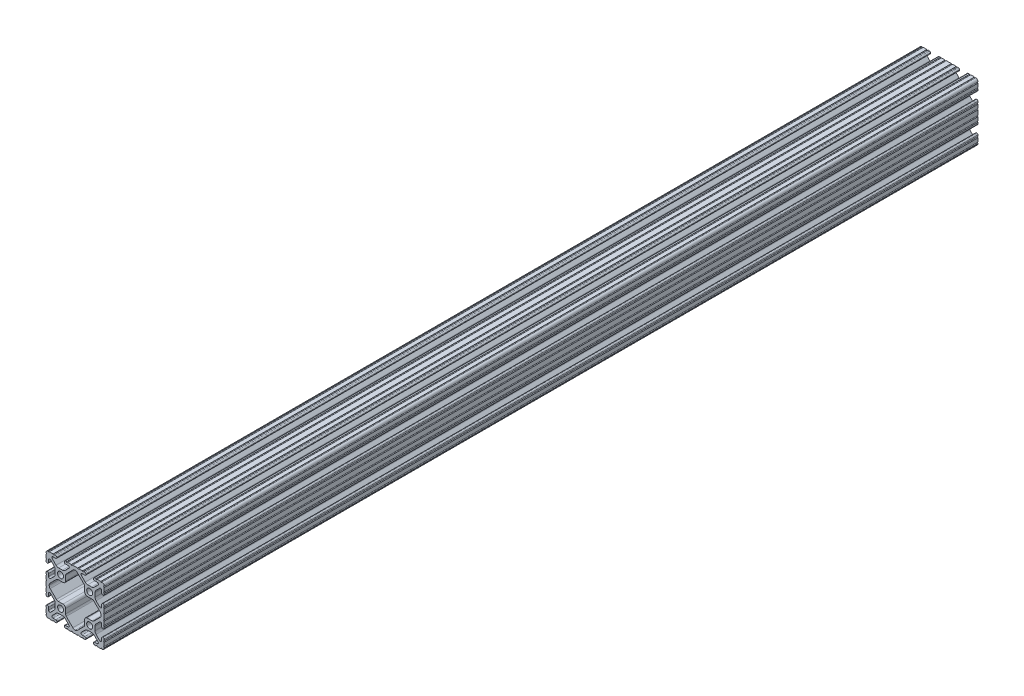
from build123d import *

# Parameters (mm, degrees)
SKETCH1_R      = 2.6035
EXTRUDE1_DEPTH = 381


with BuildPart() as part:
    # Sketch1 → Extrude1 (new, symmetric)
    with BuildSketch(Plane.XY):
        with BuildLine():
            Line((7.457926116, -25.399784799), (8.405129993, -25.399784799))
            ThreePointArc((8.405129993, -25.399784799), (9.151169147, -25.100147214), (9.461499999, -24.358492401))
            Line((9.461499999, -24.358492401), (9.461499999, -24.231492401))
            ThreePointArc((9.461499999, -24.231492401), (9.151169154, -23.489837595), (8.405130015, -23.190200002))
            Line((8.405130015, -23.190200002), (6.087754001, -23.190200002))
            ThreePointArc((6.087754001, -23.190200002), (5.173448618, -22.579280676), (5.387974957, -21.500783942))
            Line((5.387974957, -21.500783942), (8.763022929, -18.12573597))
            ThreePointArc((8.763022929, -18.12573597), (9.793067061, -17.437482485), (11.008086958, -17.195800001))
            Line((11.008086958, -17.195800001), (14.391913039, -17.195800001))
            ThreePointArc((14.391913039, -17.195800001), (15.606932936, -17.437482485), (16.636977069, -18.12573597))
            Line((16.636977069, -18.12573597), (20.01202504, -21.500783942))
            ThreePointArc((20.01202504, -21.500783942), (20.223734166, -22.586011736), (19.297652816, -23.190092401))
            Line((19.297652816, -23.190092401), (16.979899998, -23.190092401))
            ThreePointArc((16.979899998, -23.190092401), (16.243518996, -23.495111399), (15.938499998, -24.231492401))
            Line((15.938499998, -24.231492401), (15.938499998, -24.358492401))
            ThreePointArc((15.938499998, -24.358492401), (16.248830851, -25.100147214), (16.994870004, -25.399784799))
            Line((16.994870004, -25.399784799), (18.13401566, -25.399784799))
            ThreePointArc((18.13401566, -25.399784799), (18.636212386, -24.81521817), (19.138409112, -25.399784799))
            Line((19.138409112, -25.399784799), (22.413213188, -25.399784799))
            ThreePointArc((22.413213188, -25.399784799), (22.915409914, -24.815218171), (23.41760664, -25.399784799))
            Line((23.41760664, -25.399784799), (23.450078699, -25.399784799))
            ThreePointArc((23.450078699, -25.399784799), (24.83746982, -24.731205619), (25.399999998, -23.297534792))
            Line((25.399999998, -23.297534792), (25.399999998, -23.268649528))
            ThreePointArc((25.399999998, -23.268649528), (24.891999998, -22.760649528), (25.399999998, -22.252649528))
            Line((25.399999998, -22.252649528), (25.399999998, -19.025239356))
            ThreePointArc((25.399999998, -19.025239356), (24.891999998, -18.517239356), (25.399999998, -18.009239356))
            Line((25.399999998, -18.009239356), (25.399999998, -16.916041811))
            ThreePointArc((25.399999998, -16.916041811), (25.094981, -16.179660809), (24.358599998, -15.874641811))
            Line((24.358599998, -15.874641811), (24.231599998, -15.874641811))
            ThreePointArc((24.231599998, -15.874641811), (23.495218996, -16.179660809), (23.190199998, -16.916041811))
            Line((23.190199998, -16.916041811), (23.190199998, -19.10098879))
            ThreePointArc((23.190199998, -19.10098879), (22.563006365, -20.039650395), (21.455779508, -19.81940928))
            Line((21.455779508, -19.81940928), (18.278135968, -16.641765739))
            ThreePointArc((18.278135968, -16.641765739), (17.589882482, -15.611721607), (17.348199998, -14.396701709))
            Line((17.348199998, -14.396701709), (17.348199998, -11.003495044))
            ThreePointArc((17.348199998, -11.003495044), (17.59061076, -9.786718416), (18.280826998, -8.755743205))
            Line((18.280826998, -8.755743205), (21.456640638, -5.587529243))
            ThreePointArc((21.456640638, -5.587529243), (22.563568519, -5.368381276), (23.190199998, -6.306809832))
            Line((23.190199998, -6.306809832), (23.190199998, -8.483958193))
            ThreePointArc((23.190199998, -8.483958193), (23.495218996, -9.220339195), (24.231599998, -9.525358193))
            Line((24.231599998, -9.525358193), (24.358599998, -9.525358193))
            ThreePointArc((24.358599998, -9.525358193), (25.094981, -9.220339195), (25.399999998, -8.483958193))
            Line((25.399999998, -8.483958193), (25.399999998, -7.327686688))
            ThreePointArc((25.399999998, -7.327686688), (24.891999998, -6.819686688), (25.399999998, -6.311686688))
            Line((25.399999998, -6.311686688), (25.399999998, -3.084276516))
            ThreePointArc((25.399999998, -3.084276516), (24.891999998, -2.576276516), (25.399999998, -2.068276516))
            Line((25.399999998, -2.068276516), (25.399999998, 2.068276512))
            ThreePointArc((25.399999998, 2.068276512), (24.891999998, 2.576276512), (25.399999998, 3.084276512))
            Line((25.399999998, 3.084276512), (25.399999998, 6.311686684))
            ThreePointArc((25.399999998, 6.311686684), (24.891999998, 6.819686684), (25.399999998, 7.327686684))
            Line((25.399999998, 7.327686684), (25.399999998, 8.483958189))
            ThreePointArc((25.399999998, 8.483958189), (25.094981, 9.220339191), (24.358599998, 9.525358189))
            Line((24.358599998, 9.525358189), (24.231599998, 9.525358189))
            ThreePointArc((24.231599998, 9.525358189), (23.495218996, 9.220339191), (23.190199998, 8.483958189))
            Line((23.190199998, 8.483958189), (23.190199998, 6.306809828))
            ThreePointArc((23.190199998, 6.306809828), (22.563568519, 5.368381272), (21.456640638, 5.58752924))
            Line((21.456640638, 5.58752924), (18.280826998, 8.755743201))
            ThreePointArc((18.280826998, 8.755743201), (17.59061076, 9.786718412), (17.348199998, 11.00349504))
            Line((17.348199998, 11.00349504), (17.348199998, 14.396701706))
            ThreePointArc((17.348199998, 14.396701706), (17.589882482, 15.611721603), (18.278135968, 16.641765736))
            Line((18.278135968, 16.641765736), (21.455779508, 19.819409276))
            ThreePointArc((21.455779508, 19.819409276), (22.563006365, 20.039650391), (23.190199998, 19.100988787))
            Line((23.190199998, 19.100988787), (23.190199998, 16.916041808))
            ThreePointArc((23.190199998, 16.916041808), (23.495218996, 16.179660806), (24.231599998, 15.874641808))
            Line((24.231599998, 15.874641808), (24.358599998, 15.874641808))
            ThreePointArc((24.358599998, 15.874641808), (25.094981, 16.179660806), (25.399999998, 16.916041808))
            Line((25.399999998, 16.916041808), (25.399999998, 18.009239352))
            ThreePointArc((25.399999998, 18.009239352), (24.891999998, 18.517239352), (25.399999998, 19.025239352))
            Line((25.399999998, 19.025239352), (25.399999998, 22.252649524))
            ThreePointArc((25.399999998, 22.252649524), (24.891999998, 22.760649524), (25.399999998, 23.268649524))
            Line((25.399999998, 23.268649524), (25.399999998, 23.297534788))
            ThreePointArc((25.399999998, 23.297534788), (24.837469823, 24.731205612), (23.450078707, 25.399784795))
            Line((23.450078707, 25.399784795), (23.417606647, 25.399784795))
            ThreePointArc((23.417606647, 25.399784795), (22.915409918, 24.81521819), (22.413213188, 25.399784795))
            Line((22.413213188, 25.399784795), (19.138409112, 25.399784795))
            ThreePointArc((19.138409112, 25.399784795), (18.636212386, 24.815218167), (18.13401566, 25.399784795))
            Line((18.13401566, 25.399784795), (16.994870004, 25.399784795))
            ThreePointArc((16.994870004, 25.399784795), (16.248830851, 25.100147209), (15.938499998, 24.358492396))
            Line((15.938499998, 24.358492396), (15.938499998, 24.231492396))
            ThreePointArc((15.938499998, 24.231492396), (16.243518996, 23.495111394), (16.979899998, 23.190092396))
            Line((16.979899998, 23.190092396), (19.297652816, 23.190092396))
            ThreePointArc((19.297652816, 23.190092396), (20.223734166, 22.586011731), (20.01202504, 21.500783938))
            Line((20.01202504, 21.500783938), (16.636977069, 18.125735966))
            ThreePointArc((16.636977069, 18.125735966), (15.606932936, 17.437482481), (14.391913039, 17.195799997))
            Line((14.391913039, 17.195799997), (11.008086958, 17.195799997))
            ThreePointArc((11.008086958, 17.195799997), (9.793067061, 17.437482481), (8.763022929, 18.125735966))
            Line((8.763022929, 18.125735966), (5.387974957, 21.500783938))
            ThreePointArc((5.387974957, 21.500783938), (5.173448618, 22.579280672), (6.087754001, 23.190199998))
            Line((6.087754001, 23.190199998), (8.405130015, 23.190199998))
            ThreePointArc((8.405130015, 23.190199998), (9.151169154, 23.48983759), (9.461499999, 24.231492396))
            Line((9.461499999, 24.231492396), (9.461499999, 24.358492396))
            ThreePointArc((9.461499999, 24.358492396), (9.151169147, 25.10014721), (8.405129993, 25.399784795))
            Line((8.405129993, 25.399784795), (7.457926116, 25.399784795))
            ThreePointArc((7.457926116, 25.399784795), (6.95572939, 24.815218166), (6.453532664, 25.399784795))
            Line((6.453532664, 25.399784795), (3.214515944, 25.399784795))
            ThreePointArc((3.214515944, 25.399784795), (2.712319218, 24.815218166), (2.210122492, 25.399784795))
            Line((2.210122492, 25.399784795), (-2.210122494, 25.399784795))
            ThreePointArc((-2.210122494, 25.399784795), (-2.71231922, 24.815218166), (-3.214515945, 25.399784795))
            Line((-3.214515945, 25.399784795), (-6.453532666, 25.399784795))
            ThreePointArc((-6.453532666, 25.399784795), (-6.955729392, 24.815218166), (-7.457926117, 25.399784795))
            Line((-7.457926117, 25.399784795), (-8.405129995, 25.399784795))
            ThreePointArc((-8.405129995, 25.399784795), (-9.151169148, 25.10014721), (-9.461500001, 24.358492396))
            Line((-9.461500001, 24.358492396), (-9.461500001, 24.231492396))
            ThreePointArc((-9.461500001, 24.231492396), (-9.151169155, 23.48983759), (-8.405130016, 23.190199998))
            Line((-8.405130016, 23.190199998), (-6.087754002, 23.190199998))
            ThreePointArc((-6.087754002, 23.190199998), (-5.173448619, 22.579280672), (-5.387974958, 21.500783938))
            Line((-5.387974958, 21.500783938), (-8.76302293, 18.125735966))
            ThreePointArc((-8.76302293, 18.125735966), (-9.793067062, 17.437482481), (-11.00808696, 17.195799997))
            Line((-11.00808696, 17.195799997), (-14.39191304, 17.195799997))
            ThreePointArc((-14.39191304, 17.195799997), (-15.606932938, 17.437482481), (-16.63697707, 18.125735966))
            Line((-16.63697707, 18.125735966), (-20.012025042, 21.500783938))
            ThreePointArc((-20.012025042, 21.500783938), (-20.223734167, 22.586011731), (-19.297652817, 23.190092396))
            Line((-19.297652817, 23.190092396), (-16.979899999, 23.190092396))
            ThreePointArc((-16.979899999, 23.190092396), (-16.243518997, 23.495111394), (-15.938499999, 24.231492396))
            Line((-15.938499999, 24.231492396), (-15.938499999, 24.358492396))
            ThreePointArc((-15.938499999, 24.358492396), (-16.248830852, 25.100147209), (-16.994870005, 25.399784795))
            Line((-16.994870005, 25.399784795), (-18.134015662, 25.399784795))
            ThreePointArc((-18.134015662, 25.399784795), (-18.636212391, 24.815218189), (-19.13840912, 25.399784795))
            Line((-19.13840912, 25.399784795), (-22.413213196, 25.399784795))
            ThreePointArc((-22.413213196, 25.399784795), (-22.915409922, 24.815218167), (-23.417606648, 25.399784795))
            Line((-23.417606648, 25.399784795), (-23.450078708, 25.399784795))
            ThreePointArc((-23.450078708, 25.399784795), (-24.837469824, 24.731205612), (-25.399999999, 23.297534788))
            Line((-25.399999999, 23.297534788), (-25.399999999, 23.268649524))
            ThreePointArc((-25.399999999, 23.268649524), (-24.891999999, 22.760649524), (-25.399999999, 22.252649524))
            Line((-25.399999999, 22.252649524), (-25.399999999, 19.025239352))
            ThreePointArc((-25.399999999, 19.025239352), (-24.891999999, 18.517239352), (-25.399999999, 18.009239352))
            Line((-25.399999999, 18.009239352), (-25.399999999, 16.916041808))
            ThreePointArc((-25.399999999, 16.916041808), (-25.094981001, 16.179660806), (-24.358599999, 15.874641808))
            Line((-24.358599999, 15.874641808), (-24.231599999, 15.874641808))
            ThreePointArc((-24.231599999, 15.874641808), (-23.495218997, 16.179660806), (-23.190199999, 16.916041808))
            Line((-23.190199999, 16.916041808), (-23.190199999, 19.100988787))
            ThreePointArc((-23.190199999, 19.100988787), (-22.563006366, 20.039650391), (-21.45577951, 19.819409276))
            Line((-21.45577951, 19.819409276), (-18.278135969, 16.641765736))
            ThreePointArc((-18.278135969, 16.641765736), (-17.589882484, 15.611721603), (-17.348199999, 14.396701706))
            Line((-17.348199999, 14.396701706), (-17.348199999, 11.00349504))
            ThreePointArc((-17.348199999, 11.00349504), (-17.590610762, 9.786718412), (-18.280826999, 8.755743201))
            Line((-18.280826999, 8.755743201), (-21.456640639, 5.58752924))
            ThreePointArc((-21.456640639, 5.58752924), (-22.56356852, 5.368381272), (-23.190199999, 6.306809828))
            Line((-23.190199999, 6.306809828), (-23.190199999, 8.483958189))
            ThreePointArc((-23.190199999, 8.483958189), (-23.495218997, 9.220339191), (-24.231599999, 9.525358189))
            Line((-24.231599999, 9.525358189), (-24.358599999, 9.525358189))
            ThreePointArc((-24.358599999, 9.525358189), (-25.094981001, 9.220339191), (-25.399999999, 8.483958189))
            Line((-25.399999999, 8.483958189), (-25.399999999, 7.327686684))
            ThreePointArc((-25.399999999, 7.327686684), (-24.891999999, 6.819686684), (-25.399999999, 6.311686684))
            Line((-25.399999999, 6.311686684), (-25.399999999, 3.084276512))
            ThreePointArc((-25.399999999, 3.084276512), (-24.891999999, 2.576276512), (-25.399999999, 2.068276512))
            Line((-25.399999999, 2.068276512), (-25.399999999, -2.068276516))
            ThreePointArc((-25.399999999, -2.068276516), (-24.891999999, -2.576276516), (-25.399999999, -3.084276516))
            Line((-25.399999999, -3.084276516), (-25.399999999, -6.311686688))
            ThreePointArc((-25.399999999, -6.311686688), (-24.891999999, -6.819686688), (-25.399999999, -7.327686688))
            Line((-25.399999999, -7.327686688), (-25.399999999, -8.483958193))
            ThreePointArc((-25.399999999, -8.483958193), (-25.094981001, -9.220339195), (-24.358599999, -9.525358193))
            Line((-24.358599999, -9.525358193), (-24.231599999, -9.525358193))
            ThreePointArc((-24.231599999, -9.525358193), (-23.495218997, -9.220339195), (-23.190199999, -8.483958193))
            Line((-23.190199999, -8.483958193), (-23.190199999, -6.306809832))
            ThreePointArc((-23.190199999, -6.306809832), (-22.56356852, -5.368381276), (-21.456640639, -5.587529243))
            Line((-21.456640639, -5.587529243), (-18.280826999, -8.755743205))
            ThreePointArc((-18.280826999, -8.755743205), (-17.590610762, -9.786718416), (-17.348199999, -11.003495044))
            Line((-17.348199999, -11.003495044), (-17.348199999, -14.396701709))
            ThreePointArc((-17.348199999, -14.396701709), (-17.589882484, -15.611721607), (-18.278135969, -16.641765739))
            Line((-18.278135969, -16.641765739), (-21.45577951, -19.81940928))
            ThreePointArc((-21.45577951, -19.81940928), (-22.563006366, -20.039650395), (-23.190199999, -19.10098879))
            Line((-23.190199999, -19.10098879), (-23.190199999, -16.916041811))
            ThreePointArc((-23.190199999, -16.916041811), (-23.495218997, -16.179660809), (-24.231599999, -15.874641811))
            Line((-24.231599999, -15.874641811), (-24.358599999, -15.874641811))
            ThreePointArc((-24.358599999, -15.874641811), (-25.094981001, -16.179660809), (-25.399999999, -16.916041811))
            Line((-25.399999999, -16.916041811), (-25.399999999, -18.009239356))
            ThreePointArc((-25.399999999, -18.009239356), (-24.891999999, -18.517239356), (-25.399999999, -19.025239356))
            Line((-25.399999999, -19.025239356), (-25.399999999, -22.252649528))
            ThreePointArc((-25.399999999, -22.252649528), (-24.891999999, -22.760649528), (-25.399999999, -23.268649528))
            Line((-25.399999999, -23.268649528), (-25.399999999, -23.297534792))
            ThreePointArc((-25.399999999, -23.297534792), (-24.837469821, -24.731205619), (-23.450078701, -25.399784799))
            Line((-23.450078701, -25.399784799), (-23.417606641, -25.399784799))
            ThreePointArc((-23.417606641, -25.399784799), (-22.915409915, -24.81521817), (-22.413213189, -25.399784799))
            Line((-22.413213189, -25.399784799), (-19.138409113, -25.399784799))
            ThreePointArc((-19.138409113, -25.399784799), (-18.636212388, -24.81521817), (-18.134015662, -25.399784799))
            Line((-18.134015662, -25.399784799), (-16.994870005, -25.399784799))
            ThreePointArc((-16.994870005, -25.399784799), (-16.248830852, -25.100147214), (-15.938499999, -24.358492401))
            Line((-15.938499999, -24.358492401), (-15.938499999, -24.231492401))
            ThreePointArc((-15.938499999, -24.231492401), (-16.243518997, -23.495111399), (-16.979899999, -23.190092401))
            Line((-16.979899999, -23.190092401), (-19.297652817, -23.190092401))
            ThreePointArc((-19.297652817, -23.190092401), (-20.223734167, -22.586011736), (-20.012025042, -21.500783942))
            Line((-20.012025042, -21.500783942), (-16.63697707, -18.12573597))
            ThreePointArc((-16.63697707, -18.12573597), (-15.606932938, -17.437482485), (-14.39191304, -17.195800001))
            Line((-14.39191304, -17.195800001), (-11.00808696, -17.195800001))
            ThreePointArc((-11.00808696, -17.195800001), (-9.793067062, -17.437482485), (-8.76302293, -18.12573597))
            Line((-8.76302293, -18.12573597), (-5.387974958, -21.500783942))
            ThreePointArc((-5.387974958, -21.500783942), (-5.173448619, -22.579280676), (-6.087754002, -23.190200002))
            Line((-6.087754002, -23.190200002), (-8.405130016, -23.190200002))
            ThreePointArc((-8.405130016, -23.190200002), (-9.151169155, -23.489837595), (-9.461500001, -24.231492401))
            Line((-9.461500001, -24.231492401), (-9.461500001, -24.358492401))
            ThreePointArc((-9.461500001, -24.358492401), (-9.151169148, -25.100147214), (-8.405129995, -25.399784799))
            Line((-8.405129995, -25.399784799), (-7.457926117, -25.399784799))
            ThreePointArc((-7.457926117, -25.399784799), (-6.955729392, -24.81521817), (-6.453532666, -25.399784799))
            Line((-6.453532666, -25.399784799), (-3.214515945, -25.399784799))
            ThreePointArc((-3.214515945, -25.399784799), (-2.71231922, -24.81521817), (-2.210122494, -25.399784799))
            Line((-2.210122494, -25.399784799), (2.210122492, -25.399784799))
            ThreePointArc((2.210122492, -25.399784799), (2.712319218, -24.81521817), (3.214515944, -25.399784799))
            Line((3.214515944, -25.399784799), (6.453532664, -25.399784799))
            ThreePointArc((6.453532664, -25.399784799), (6.95572939, -24.815218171), (7.457926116, -25.399784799))
        make_face()
        with Locations((12.7, 12.7)):
            Circle(SKETCH1_R, mode=Mode.SUBTRACT)
        with Locations((-12.7, 12.7)):
            Circle(SKETCH1_R, mode=Mode.SUBTRACT)
        with Locations((-12.7, -12.7)):
            Circle(SKETCH1_R, mode=Mode.SUBTRACT)
        with Locations((12.7, -12.7)):
            Circle(SKETCH1_R, mode=Mode.SUBTRACT)
        with BuildLine():
            Line((-7.683964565, -16.079665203), (-1.987770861, -21.775858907))
            ThreePointArc((-1.987770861, -21.775858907), (-1.075921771, -22.393947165), (0, -22.630366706))
            ThreePointArc((0, -22.630366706), (1.07592177, -22.393947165), (1.98777086, -21.775858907))
            Line((1.98777086, -21.775858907), (7.683964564, -16.079665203))
            ThreePointArc((7.683964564, -16.079665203), (8.16298899, -15.362754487), (8.331199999, -14.517100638))
            Line((8.331199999, -14.517100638), (8.331199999, -10.3886))
            ThreePointArc((8.331199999, -10.3886), (8.978435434, -8.826035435), (10.540999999, -8.1788))
            Line((10.540999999, -8.1788), (14.816495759, -8.1788))
            ThreePointArc((14.816495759, -8.1788), (15.66092662, -8.01109514), (16.377187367, -7.53343528))
            Line((16.377187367, -7.53343528), (21.773383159, -2.150152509))
            ThreePointArc((21.773383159, -2.150152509), (22.408382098, -1.201655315), (22.631399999, -0.082220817))
            Line((22.631399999, -0.082220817), (22.631399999, 0.082220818))
            ThreePointArc((22.631399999, 0.082220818), (22.408382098, 1.201655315), (21.773383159, 2.150152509))
            Line((21.773383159, 2.150152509), (16.376754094, 7.533867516))
            ThreePointArc((16.376754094, 7.533867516), (15.660493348, 8.011527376), (14.816062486, 8.179232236))
            Line((14.816062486, 8.179232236), (10.540999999, 8.179232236))
            ThreePointArc((10.540999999, 8.179232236), (8.978435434, 8.826467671), (8.331199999, 10.389032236))
            Line((8.331199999, 10.389032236), (8.331199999, 14.517100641))
            ThreePointArc((8.331199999, 14.517100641), (8.16298899, 15.362754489), (7.683964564, 16.079665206))
            Line((7.683964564, 16.079665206), (1.795557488, 21.968072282))
            ThreePointArc((1.795557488, 21.968072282), (0.971532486, 22.546678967), (1.3e-08, 22.811117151))
            ThreePointArc((1.3e-08, 22.811117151), (-0.971532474, 22.54667897), (-1.795557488, 21.96807228))
            Line((-1.795557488, 21.96807228), (-7.683964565, 16.079665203))
            ThreePointArc((-7.683964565, 16.079665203), (-8.162988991, 15.362754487), (-8.3312, 14.517100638))
            Line((-8.3312, 14.517100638), (-8.3312, 10.3886))
            ThreePointArc((-8.3312, 10.3886), (-8.978435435, 8.826035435), (-10.541, 8.1788))
            Line((-10.541, 8.1788), (-14.816495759, 8.1788))
            ThreePointArc((-14.816495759, 8.1788), (-15.660926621, 8.01109514), (-16.377187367, 7.53343528))
            Line((-16.377187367, 7.53343528), (-21.77338316, 2.150152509))
            ThreePointArc((-21.77338316, 2.150152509), (-22.408382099, 1.201655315), (-22.6314, 0.082220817))
            Line((-22.6314, 0.082220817), (-22.6314, -0.082220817))
            ThreePointArc((-22.6314, -0.082220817), (-22.408382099, -1.201655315), (-21.77338316, -2.150152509))
            Line((-21.77338316, -2.150152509), (-16.377187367, -7.53343528))
            ThreePointArc((-16.377187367, -7.53343528), (-15.660926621, -8.01109514), (-14.816495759, -8.1788))
            Line((-14.816495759, -8.1788), (-10.541, -8.1788))
            ThreePointArc((-10.541, -8.1788), (-8.978435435, -8.826035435), (-8.3312, -10.3886))
            Line((-8.3312, -10.3886), (-8.3312, -14.517100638))
            ThreePointArc((-8.3312, -14.517100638), (-8.162988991, -15.362754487), (-7.683964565, -16.079665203))
        make_face(mode=Mode.SUBTRACT)
    extrude(amount=EXTRUDE1_DEPTH, both=True)


solid = part.part
